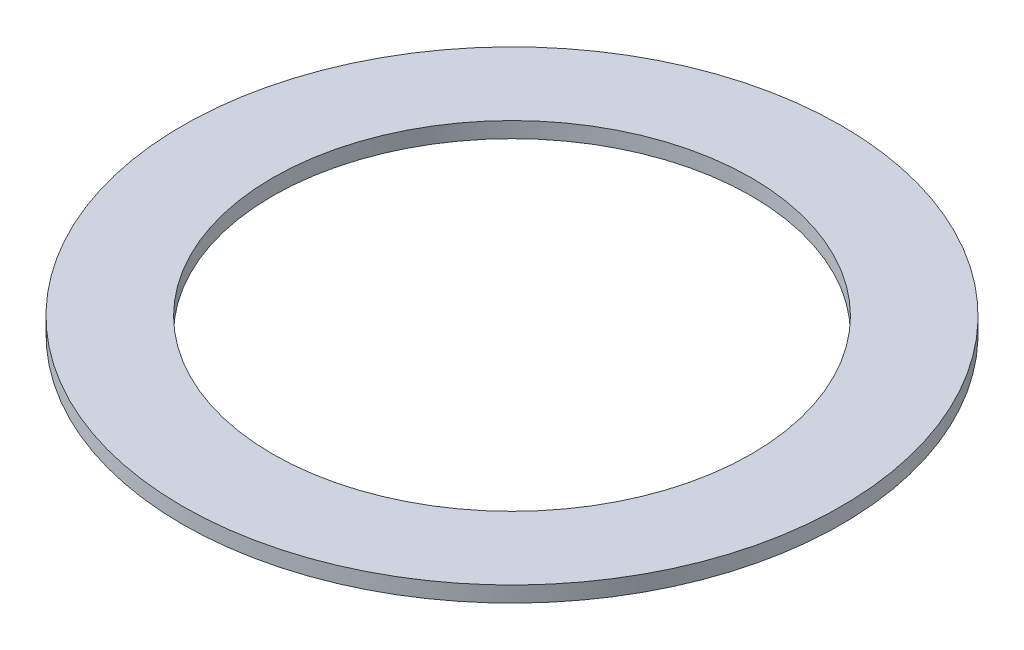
from build123d import *

# Parameters (mm, degrees)
ESQUISSE1_W = 5.75
ESQUISSE1_H = 1


with BuildPart() as part:
    # Esquisse1 → R_volution1 (revolve)
    with BuildSketch(Plane.XY, mode=Mode.PRIVATE) as r_volution1_sk:
        with Locations((18.125, 0.5)):
            Rectangle(ESQUISSE1_W, ESQUISSE1_H)
    revolve(r_volution1_sk.sketch.rotate(Axis((0, 0, 0), (0, 1, 0)), 90), axis=Axis((0, 0, 0), (0, 1, 0)))


solid = part.part
